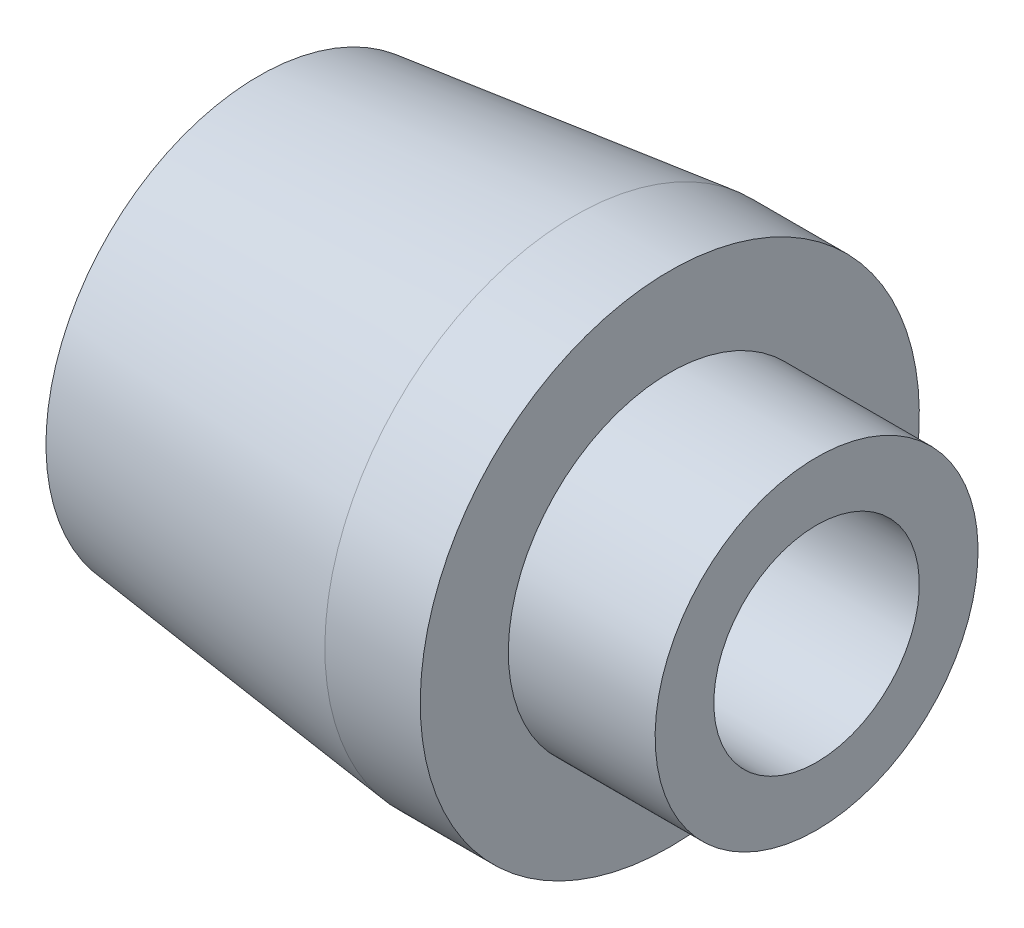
ISO-10303-21;
HEADER;
FILE_DESCRIPTION(('STEP AP214'),'2;1');
FILE_NAME('part.step','',(''),(''),'','','');
FILE_SCHEMA(('AUTOMOTIVE_DESIGN { 1 0 10303 214 1 1 1 1 }'));
ENDSEC;
DATA;
#1=APPLICATION_CONTEXT('core data for automotive mechanical design processes');
#2=APPLICATION_PROTOCOL_DEFINITION('international standard','automotive_design',2000,#1);
#3=PRODUCT_CONTEXT('',#1,'mechanical');
#4=PRODUCT('Part','Part','',(#3));
#5=PRODUCT_RELATED_PRODUCT_CATEGORY('part','',(#4));
#6=PRODUCT_DEFINITION_FORMATION('','',#4);
#7=PRODUCT_DEFINITION_CONTEXT('part definition',#1,'design');
#8=PRODUCT_DEFINITION('design','',#6,#7);
#9=PRODUCT_DEFINITION_SHAPE('','',#8);
#10=(LENGTH_UNIT() NAMED_UNIT(*) SI_UNIT(.MILLI.,.METRE.));
#11=(NAMED_UNIT(*) PLANE_ANGLE_UNIT() SI_UNIT($,.RADIAN.));
#12=(NAMED_UNIT(*) SI_UNIT($,.STERADIAN.) SOLID_ANGLE_UNIT());
#13=UNCERTAINTY_MEASURE_WITH_UNIT(LENGTH_MEASURE(1.E-05),#10,'distance_accuracy_value','');
#14=(GEOMETRIC_REPRESENTATION_CONTEXT(3) GLOBAL_UNCERTAINTY_ASSIGNED_CONTEXT((#13)) GLOBAL_UNIT_ASSIGNED_CONTEXT((#10,
#11,#12)) REPRESENTATION_CONTEXT('',''));
#15=CARTESIAN_POINT('',(0.,0.,0.));
#16=DIRECTION('',(0.,0.,1.));
#17=DIRECTION('',(1.,0.,0.));
#18=AXIS2_PLACEMENT_3D('',#15,#16,#17);
#19=CARTESIAN_POINT('',(9.9999999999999,6.99999999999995,0.));
#20=DIRECTION('',(-1.,0.,0.));
#21=DIRECTION('',(0.,-1.,0.));
#22=AXIS2_PLACEMENT_3D('',#19,#20,#21);
#23=PLANE('',#22);
#24=CARTESIAN_POINT('',(9.9999999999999,0.,0.));
#25=DIRECTION('',(-1.,0.,0.));
#26=DIRECTION('',(0.,-1.,0.));
#27=AXIS2_PLACEMENT_3D('',#24,#25,#26);
#28=CIRCLE('',#27,11.);
#29=CARTESIAN_POINT('',(9.9999999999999,-11.,0.));
#30=VERTEX_POINT('',#29);
#31=EDGE_CURVE('E10',#30,#30,#28,.T.);
#32=ORIENTED_EDGE('',*,*,#31,.F.);
#33=EDGE_LOOP('',(#32));
#34=FACE_BOUND('',#33,.T.);
#35=CARTESIAN_POINT('',(9.9999999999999,0.,0.));
#36=DIRECTION('',(-1.,0.,0.));
#37=DIRECTION('',(0.,-1.,0.));
#38=AXIS2_PLACEMENT_3D('',#35,#36,#37);
#39=CIRCLE('',#38,6.99999999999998);
#40=CARTESIAN_POINT('',(9.9999999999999,-7.00000000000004,0.));
#41=VERTEX_POINT('',#40);
#42=EDGE_CURVE('E51',#41,#41,#39,.T.);
#43=ORIENTED_EDGE('',*,*,#42,.T.);
#44=EDGE_LOOP('',(#43));
#45=FACE_BOUND('',#44,.T.);
#46=ADVANCED_FACE('F26',(#34,#45),#23,.F.);
#47=CARTESIAN_POINT('',(-90.0000000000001,0.,0.));
#48=DIRECTION('',(-1.,0.,0.));
#49=DIRECTION('',(0.,-1.,0.));
#50=AXIS2_PLACEMENT_3D('',#47,#48,#49);
#51=CYLINDRICAL_SURFACE('',#50,11.);
#52=CARTESIAN_POINT('',(-1.11022302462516E-13,0.,0.));
#53=DIRECTION('',(-1.,0.,0.));
#54=DIRECTION('',(0.,-1.,0.));
#55=AXIS2_PLACEMENT_3D('',#52,#53,#54);
#56=CIRCLE('',#55,11.);
#57=CARTESIAN_POINT('',(-1.12022454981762E-13,-11.,0.));
#58=VERTEX_POINT('',#57);
#59=EDGE_CURVE('E32',#58,#58,#56,.T.);
#60=ORIENTED_EDGE('',*,*,#59,.F.);
#61=EDGE_LOOP('',(#60));
#62=FACE_BOUND('',#61,.T.);
#63=ORIENTED_EDGE('',*,*,#31,.T.);
#64=EDGE_LOOP('',(#63));
#65=FACE_BOUND('',#64,.T.);
#66=ADVANCED_FACE('F82',(#62,#65),#51,.T.);
#67=CARTESIAN_POINT('',(-1.11022302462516E-13,11.,0.));
#68=DIRECTION('',(-1.,0.,0.));
#69=DIRECTION('',(0.,-1.,0.));
#70=AXIS2_PLACEMENT_3D('',#67,#68,#69);
#71=PLANE('',#70);
#72=CARTESIAN_POINT('',(-1.11022302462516E-13,0.,0.));
#73=DIRECTION('',(-1.,0.,0.));
#74=DIRECTION('',(0.,-1.,0.));
#75=AXIS2_PLACEMENT_3D('',#72,#73,#74);
#76=CIRCLE('',#75,17.);
#77=CARTESIAN_POINT('',(-1.12567992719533E-13,-17.,0.));
#78=VERTEX_POINT('',#77);
#79=EDGE_CURVE('E36',#78,#78,#76,.T.);
#80=ORIENTED_EDGE('',*,*,#79,.F.);
#81=EDGE_LOOP('',(#80));
#82=FACE_BOUND('',#81,.T.);
#83=ORIENTED_EDGE('',*,*,#59,.T.);
#84=EDGE_LOOP('',(#83));
#85=FACE_BOUND('',#84,.T.);
#86=ADVANCED_FACE('F77',(#82,#85),#71,.F.);
#87=CARTESIAN_POINT('',(-90.0000000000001,0.,0.));
#88=DIRECTION('',(-1.,0.,0.));
#89=DIRECTION('',(0.,-1.,0.));
#90=AXIS2_PLACEMENT_3D('',#87,#88,#89);
#91=CYLINDRICAL_SURFACE('',#90,17.);
#92=CARTESIAN_POINT('',(-6.50000000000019,0.,0.));
#93=DIRECTION('',(-1.,0.,0.));
#94=DIRECTION('',(0.,-1.,0.));
#95=AXIS2_PLACEMENT_3D('',#92,#93,#94);
#96=CIRCLE('',#95,17.);
#97=CARTESIAN_POINT('',(-6.50000000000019,-17.,0.));
#98=VERTEX_POINT('',#97);
#99=EDGE_CURVE('E40',#98,#98,#96,.T.);
#100=ORIENTED_EDGE('',*,*,#99,.F.);
#101=EDGE_LOOP('',(#100));
#102=FACE_BOUND('',#101,.T.);
#103=ORIENTED_EDGE('',*,*,#79,.T.);
#104=EDGE_LOOP('',(#103));
#105=FACE_BOUND('',#104,.T.);
#106=ADVANCED_FACE('F71',(#102,#105),#91,.T.);
#107=CARTESIAN_POINT('',(-6.50000000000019,0.,0.));
#108=DIRECTION('',(1.,0.,0.));
#109=DIRECTION('',(0.,1.,0.));
#110=AXIS2_PLACEMENT_3D('',#107,#108,#109);
#111=CONICAL_SURFACE('',#110,17.,0.115759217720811);
#112=CARTESIAN_POINT('',(-28.0000000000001,-1.11022302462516E-13,0.));
#113=DIRECTION('',(-1.,0.,0.));
#114=DIRECTION('',(0.,-1.,0.));
#115=AXIS2_PLACEMENT_3D('',#112,#113,#114);
#116=CIRCLE('',#115,14.5);
#117=CARTESIAN_POINT('',(-28.0000000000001,-14.5000000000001,0.));
#118=VERTEX_POINT('',#117);
#119=EDGE_CURVE('E45',#118,#118,#116,.T.);
#120=ORIENTED_EDGE('',*,*,#119,.F.);
#121=EDGE_LOOP('',(#120));
#122=FACE_BOUND('',#121,.T.);
#123=ORIENTED_EDGE('',*,*,#99,.T.);
#124=EDGE_LOOP('',(#123));
#125=FACE_BOUND('',#124,.T.);
#126=ADVANCED_FACE('F65',(#122,#125),#111,.T.);
#127=CARTESIAN_POINT('',(-28.,14.4999999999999,0.));
#128=DIRECTION('',(1.,0.,0.));
#129=DIRECTION('',(0.,1.,0.));
#130=AXIS2_PLACEMENT_3D('',#127,#128,#129);
#131=PLANE('',#130);
#132=CARTESIAN_POINT('',(-28.0000000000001,-1.11022302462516E-13,0.));
#133=DIRECTION('',(-1.,0.,0.));
#134=DIRECTION('',(0.,-1.,0.));
#135=AXIS2_PLACEMENT_3D('',#132,#133,#134);
#136=CIRCLE('',#135,6.99999999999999);
#137=CARTESIAN_POINT('',(-28.0000000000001,-7.0000000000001,0.));
#138=VERTEX_POINT('',#137);
#139=EDGE_CURVE('E48',#138,#138,#136,.T.);
#140=ORIENTED_EDGE('',*,*,#139,.F.);
#141=EDGE_LOOP('',(#140));
#142=FACE_BOUND('',#141,.T.);
#143=ORIENTED_EDGE('',*,*,#119,.T.);
#144=EDGE_LOOP('',(#143));
#145=FACE_BOUND('',#144,.T.);
#146=ADVANCED_FACE('F59',(#142,#145),#131,.F.);
#147=CARTESIAN_POINT('',(-90.0000000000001,0.,0.));
#148=DIRECTION('',(-1.,0.,0.));
#149=DIRECTION('',(0.,-1.,0.));
#150=AXIS2_PLACEMENT_3D('',#147,#148,#149);
#151=CYLINDRICAL_SURFACE('',#150,6.99999999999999);
#152=ORIENTED_EDGE('',*,*,#42,.F.);
#153=EDGE_LOOP('',(#152));
#154=FACE_BOUND('',#153,.T.);
#155=ORIENTED_EDGE('',*,*,#139,.T.);
#156=EDGE_LOOP('',(#155));
#157=FACE_BOUND('',#156,.T.);
#158=ADVANCED_FACE('F56',(#154,#157),#151,.F.);
#159=CLOSED_SHELL('',(#46,#66,#86,#106,#126,#146,#158));
#160=MANIFOLD_SOLID_BREP('B2',#159);
#161=ADVANCED_BREP_SHAPE_REPRESENTATION('',(#18,#160),#14);
#162=SHAPE_DEFINITION_REPRESENTATION(#9,#161);
ENDSEC;
END-ISO-10303-21;
